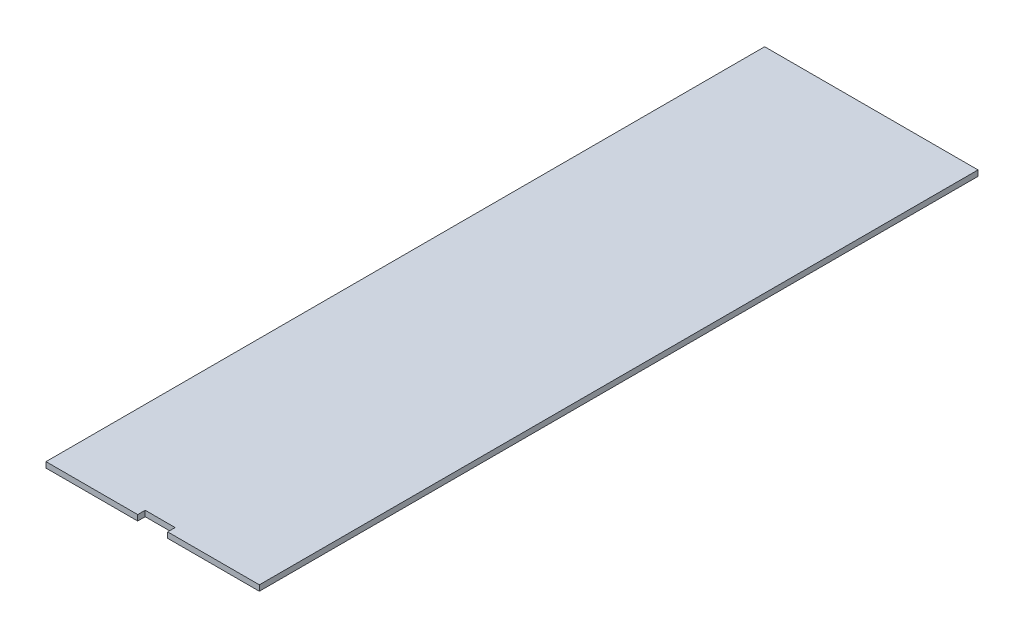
from build123d import *

# Parameters (mm, degrees)
BOSS_EXTRUDE1_DEPTH = 4.7625


with BuildPart() as part:
    # Sketch1 → Boss-Extrude1 (new body)
    with BuildSketch(Plane(origin=(0, 0, 0), x_dir=(1, 0, 0), z_dir=(0, 1, 0))):
        Polygon((103.1875, 0), (180.975, 0), (180.975, 609.6), (0, 609.6), (0, 0), (77.7875, 0), (77.7875, 6.35), (103.1875, 6.35), align=None)
    extrude(amount=BOSS_EXTRUDE1_DEPTH)


solid = part.part
